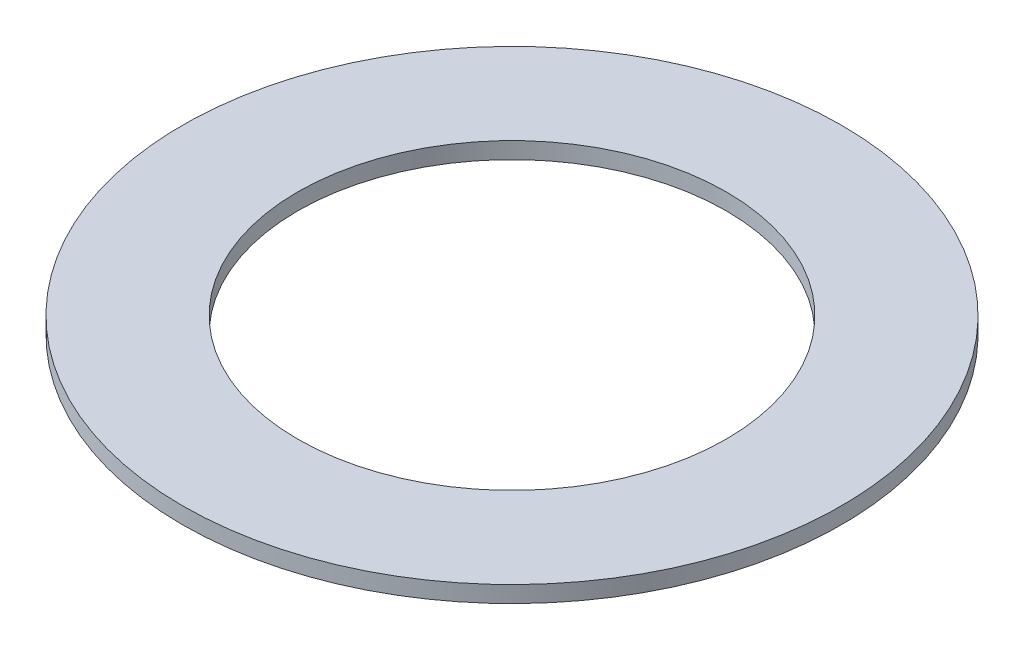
ISO-10303-21;
HEADER;
FILE_DESCRIPTION(('STEP AP214'),'2;1');
FILE_NAME('part.step','',(''),(''),'','','');
FILE_SCHEMA(('AUTOMOTIVE_DESIGN { 1 0 10303 214 1 1 1 1 }'));
ENDSEC;
DATA;
#1=APPLICATION_CONTEXT('core data for automotive mechanical design processes');
#2=APPLICATION_PROTOCOL_DEFINITION('international standard','automotive_design',2000,#1);
#3=PRODUCT_CONTEXT('',#1,'mechanical');
#4=PRODUCT('Part','Part','',(#3));
#5=PRODUCT_RELATED_PRODUCT_CATEGORY('part','',(#4));
#6=PRODUCT_DEFINITION_FORMATION('','',#4);
#7=PRODUCT_DEFINITION_CONTEXT('part definition',#1,'design');
#8=PRODUCT_DEFINITION('design','',#6,#7);
#9=PRODUCT_DEFINITION_SHAPE('','',#8);
#10=(LENGTH_UNIT() NAMED_UNIT(*) SI_UNIT(.MILLI.,.METRE.));
#11=(NAMED_UNIT(*) PLANE_ANGLE_UNIT() SI_UNIT($,.RADIAN.));
#12=(NAMED_UNIT(*) SI_UNIT($,.STERADIAN.) SOLID_ANGLE_UNIT());
#13=UNCERTAINTY_MEASURE_WITH_UNIT(LENGTH_MEASURE(1.E-05),#10,'distance_accuracy_value','');
#14=(GEOMETRIC_REPRESENTATION_CONTEXT(3) GLOBAL_UNCERTAINTY_ASSIGNED_CONTEXT((#13)) GLOBAL_UNIT_ASSIGNED_CONTEXT((#10,
#11,#12)) REPRESENTATION_CONTEXT('',''));
#15=CARTESIAN_POINT('',(0.,0.,0.));
#16=DIRECTION('',(0.,0.,1.));
#17=DIRECTION('',(1.,0.,0.));
#18=AXIS2_PLACEMENT_3D('',#15,#16,#17);
#19=CARTESIAN_POINT('',(10.,0.,0.));
#20=DIRECTION('',(0.,-1.,0.));
#21=DIRECTION('',(0.,0.,-1.));
#22=AXIS2_PLACEMENT_3D('',#19,#20,#21);
#23=PLANE('',#22);
#24=CARTESIAN_POINT('',(0.,0.,0.));
#25=DIRECTION('',(0.,-1.,0.));
#26=DIRECTION('',(0.,0.,-1.));
#27=AXIS2_PLACEMENT_3D('',#24,#25,#26);
#28=CIRCLE('',#27,10.);
#29=CARTESIAN_POINT('',(0.,0.,-10.));
#30=VERTEX_POINT('',#29);
#31=EDGE_CURVE('E43',#30,#30,#28,.T.);
#32=ORIENTED_EDGE('',*,*,#31,.T.);
#33=EDGE_LOOP('',(#32));
#34=FACE_BOUND('',#33,.T.);
#35=CARTESIAN_POINT('',(0.,0.,0.));
#36=DIRECTION('',(0.,-1.,0.));
#37=DIRECTION('',(0.,0.,-1.));
#38=AXIS2_PLACEMENT_3D('',#35,#36,#37);
#39=CIRCLE('',#38,6.5);
#40=CARTESIAN_POINT('',(0.,0.,-6.5));
#41=VERTEX_POINT('',#40);
#42=EDGE_CURVE('E10',#41,#41,#39,.T.);
#43=ORIENTED_EDGE('',*,*,#42,.F.);
#44=EDGE_LOOP('',(#43));
#45=FACE_BOUND('',#44,.T.);
#46=ADVANCED_FACE('F29',(#34,#45),#23,.T.);
#47=CARTESIAN_POINT('',(0.,0.,0.));
#48=DIRECTION('',(0.,-1.,0.));
#49=DIRECTION('',(0.,0.,-1.));
#50=AXIS2_PLACEMENT_3D('',#47,#48,#49);
#51=CYLINDRICAL_SURFACE('',#50,6.5);
#52=ORIENTED_EDGE('',*,*,#42,.T.);
#53=EDGE_LOOP('',(#52));
#54=FACE_BOUND('',#53,.T.);
#55=CARTESIAN_POINT('',(0.,0.5,0.));
#56=DIRECTION('',(0.,-1.,0.));
#57=DIRECTION('',(0.,0.,-1.));
#58=AXIS2_PLACEMENT_3D('',#55,#56,#57);
#59=CIRCLE('',#58,6.5);
#60=CARTESIAN_POINT('',(0.,0.5,-6.5));
#61=VERTEX_POINT('',#60);
#62=EDGE_CURVE('E35',#61,#61,#59,.T.);
#63=ORIENTED_EDGE('',*,*,#62,.F.);
#64=EDGE_LOOP('',(#63));
#65=FACE_BOUND('',#64,.T.);
#66=ADVANCED_FACE('F59',(#54,#65),#51,.F.);
#67=CARTESIAN_POINT('',(6.50000000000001,0.5,0.));
#68=DIRECTION('',(0.,1.,0.));
#69=DIRECTION('',(0.,0.,1.));
#70=AXIS2_PLACEMENT_3D('',#67,#68,#69);
#71=PLANE('',#70);
#72=ORIENTED_EDGE('',*,*,#62,.T.);
#73=EDGE_LOOP('',(#72));
#74=FACE_BOUND('',#73,.T.);
#75=CARTESIAN_POINT('',(0.,0.5,0.));
#76=DIRECTION('',(0.,-1.,0.));
#77=DIRECTION('',(0.,0.,-1.));
#78=AXIS2_PLACEMENT_3D('',#75,#76,#77);
#79=CIRCLE('',#78,10.);
#80=CARTESIAN_POINT('',(0.,0.5,-10.));
#81=VERTEX_POINT('',#80);
#82=EDGE_CURVE('E39',#81,#81,#79,.T.);
#83=ORIENTED_EDGE('',*,*,#82,.F.);
#84=EDGE_LOOP('',(#83));
#85=FACE_BOUND('',#84,.T.);
#86=ADVANCED_FACE('F53',(#74,#85),#71,.T.);
#87=CARTESIAN_POINT('',(0.,0.,0.));
#88=DIRECTION('',(0.,-1.,0.));
#89=DIRECTION('',(0.,0.,-1.));
#90=AXIS2_PLACEMENT_3D('',#87,#88,#89);
#91=CYLINDRICAL_SURFACE('',#90,10.);
#92=ORIENTED_EDGE('',*,*,#82,.T.);
#93=EDGE_LOOP('',(#92));
#94=FACE_BOUND('',#93,.T.);
#95=ORIENTED_EDGE('',*,*,#31,.F.);
#96=EDGE_LOOP('',(#95));
#97=FACE_BOUND('',#96,.T.);
#98=ADVANCED_FACE('F51',(#94,#97),#91,.T.);
#99=CLOSED_SHELL('',(#46,#66,#86,#98));
#100=MANIFOLD_SOLID_BREP('B2',#99);
#101=ADVANCED_BREP_SHAPE_REPRESENTATION('',(#18,#100),#14);
#102=SHAPE_DEFINITION_REPRESENTATION(#9,#101);
ENDSEC;
END-ISO-10303-21;
